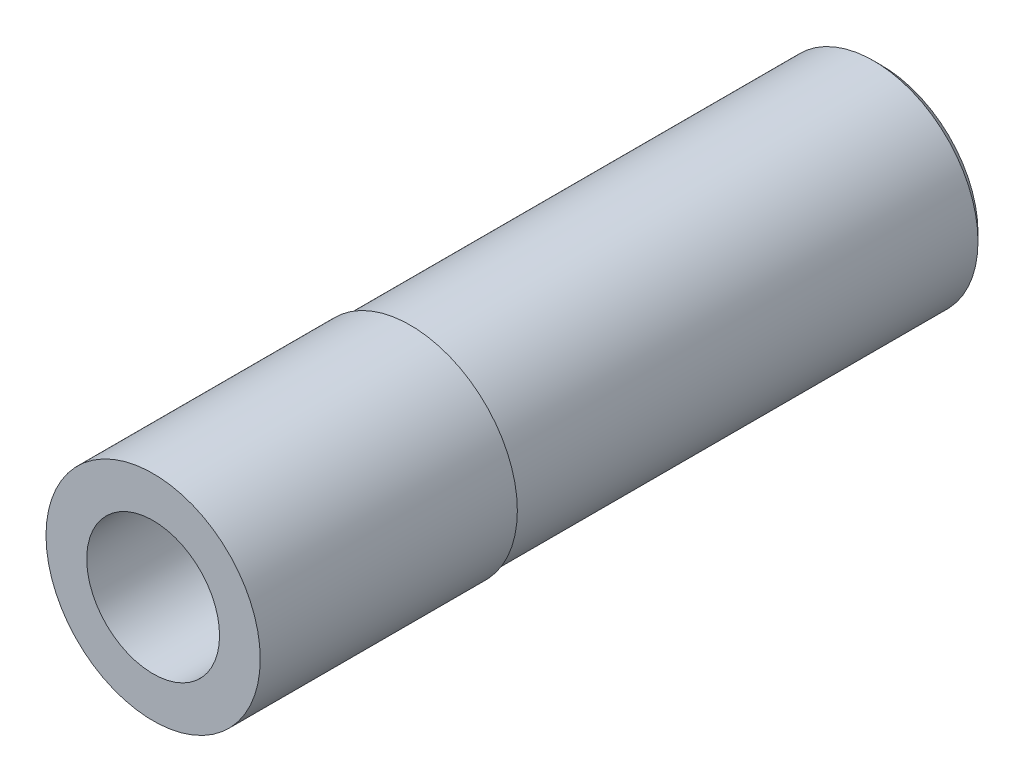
from build123d import *

# Parameters (mm, degrees)
SKETCH4_W          = 11
SKETCH4_H          = 1
CUT_EXTRUDE2_DEPTH = 1.4


with BuildPart() as part:
    # Sketch1 → Revolve1 (revolve)
    with BuildSketch(Plane(origin=(0, 0, 0), x_dir=(0, 0, -1), z_dir=(1, 0, 0)), mode=Mode.PRIVATE) as revolve1_sk:
        Polygon((0, 2.5), (0, 1.55), (2.8, 1.55), (2.8, 0.8), (14, 0.8), (14, 1.5), (17, 1.5), (17, 2.25), (16.75, 2.5), align=None)
    revolve(revolve1_sk.sketch.rotate(Axis((0, 0, 3.797909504), (0, 0, -1)), 90), axis=Axis((0, 0, 3.797909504), (0, 0, -1)))

    # Sketch4 → Cut-Revolve1 (revolve, cut)
    with BuildSketch(Plane(origin=(0, 0, 0), x_dir=(0, 0, -1), z_dir=(1, 0, 0)), mode=Mode.PRIVATE) as cut_revolve1_sk:
        with Locations((11.5, 2.935)):
            Rectangle(SKETCH4_W, SKETCH4_H)
    revolve(cut_revolve1_sk.sketch.rotate(Axis((0, 0, 0), (0, 0, -1)), 90), axis=Axis((0, 0, 0), (0, 0, -1)), mode=Mode.SUBTRACT)

    # Sketch3 → Cut-Extrude2 (cut)
    with BuildSketch(Plane.XY.offset(-2.8)):
        Polygon((0.461880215, 0.8), (-0.461880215, 0.8), (-0.923760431, 0), (-0.461880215, -0.8), (0.461880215, -0.8), (0.923760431, 0), align=None)
    extrude(amount=-CUT_EXTRUDE2_DEPTH, mode=Mode.SUBTRACT)


solid = part.part
